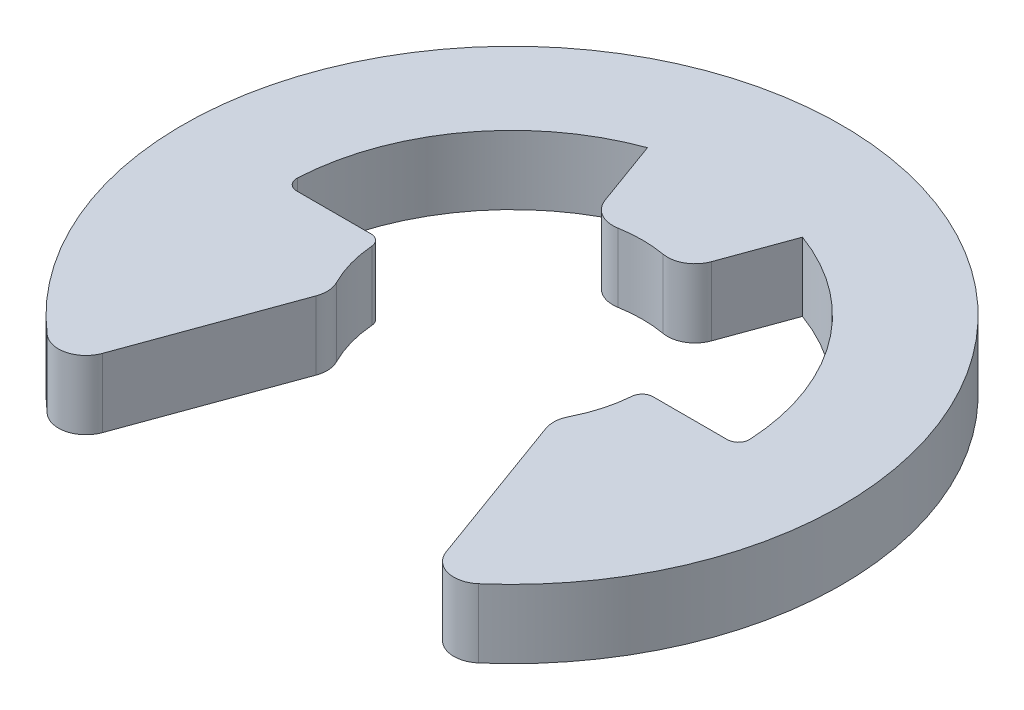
ISO-10303-21;
HEADER;
FILE_DESCRIPTION(('STEP AP214'),'2;1');
FILE_NAME('part.step','',(''),(''),'','','');
FILE_SCHEMA(('AUTOMOTIVE_DESIGN { 1 0 10303 214 1 1 1 1 }'));
ENDSEC;
DATA;
#1=APPLICATION_CONTEXT('core data for automotive mechanical design processes');
#2=APPLICATION_PROTOCOL_DEFINITION('international standard','automotive_design',2000,#1);
#3=PRODUCT_CONTEXT('',#1,'mechanical');
#4=PRODUCT('Part','Part','',(#3));
#5=PRODUCT_RELATED_PRODUCT_CATEGORY('part','',(#4));
#6=PRODUCT_DEFINITION_FORMATION('','',#4);
#7=PRODUCT_DEFINITION_CONTEXT('part definition',#1,'design');
#8=PRODUCT_DEFINITION('design','',#6,#7);
#9=PRODUCT_DEFINITION_SHAPE('','',#8);
#10=(LENGTH_UNIT() NAMED_UNIT(*) SI_UNIT(.MILLI.,.METRE.));
#11=(NAMED_UNIT(*) PLANE_ANGLE_UNIT() SI_UNIT($,.RADIAN.));
#12=(NAMED_UNIT(*) SI_UNIT($,.STERADIAN.) SOLID_ANGLE_UNIT());
#13=UNCERTAINTY_MEASURE_WITH_UNIT(LENGTH_MEASURE(1.E-05),#10,'distance_accuracy_value','');
#14=(GEOMETRIC_REPRESENTATION_CONTEXT(3) GLOBAL_UNCERTAINTY_ASSIGNED_CONTEXT((#13)) GLOBAL_UNIT_ASSIGNED_CONTEXT((#10,
#11,#12)) REPRESENTATION_CONTEXT('',''));
#15=CARTESIAN_POINT('',(0.,0.,0.));
#16=DIRECTION('',(0.,0.,1.));
#17=DIRECTION('',(1.,0.,0.));
#18=AXIS2_PLACEMENT_3D('',#15,#16,#17);
#19=CARTESIAN_POINT('',(0.,0.25,0.));
#20=DIRECTION('',(0.,-1.,0.));
#21=DIRECTION('',(0.,0.,-1.));
#22=AXIS2_PLACEMENT_3D('',#19,#20,#21);
#23=CYLINDRICAL_SURFACE('',#22,1.65);
#24=CARTESIAN_POINT('',(0.,0.25,0.));
#25=DIRECTION('',(0.,-1.,0.));
#26=DIRECTION('',(0.,0.,1.));
#27=AXIS2_PLACEMENT_3D('',#24,#25,#26);
#28=CIRCLE('',#27,1.65);
#29=CARTESIAN_POINT('',(-1.64785653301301,0.25,-0.0840764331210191));
#30=VERTEX_POINT('',#29);
#31=CARTESIAN_POINT('',(-0.564333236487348,0.25,-1.55049282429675));
#32=VERTEX_POINT('',#31);
#33=EDGE_CURVE('E187',#30,#32,#28,.T.);
#34=ORIENTED_EDGE('',*,*,#33,.F.);
#35=DIRECTION('',(0.,-1.,0.));
#36=VECTOR('',#35,1.);
#37=CARTESIAN_POINT('',(-1.64785653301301,0.25,-0.0840764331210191));
#38=LINE('',#37,#36);
#39=CARTESIAN_POINT('',(-1.64785653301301,-0.25,-0.0840764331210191));
#40=VERTEX_POINT('',#39);
#41=EDGE_CURVE('E327',#30,#40,#38,.T.);
#42=ORIENTED_EDGE('',*,*,#41,.T.);
#43=CARTESIAN_POINT('',(0.,-0.25,0.));
#44=DIRECTION('',(0.,-1.,0.));
#45=DIRECTION('',(0.,0.,1.));
#46=AXIS2_PLACEMENT_3D('',#43,#44,#45);
#47=CIRCLE('',#46,1.65);
#48=CARTESIAN_POINT('',(-0.564333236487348,-0.25,-1.55049282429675));
#49=VERTEX_POINT('',#48);
#50=EDGE_CURVE('E211',#40,#49,#47,.T.);
#51=ORIENTED_EDGE('',*,*,#50,.T.);
#52=DIRECTION('',(0.,-1.,0.));
#53=VECTOR('',#52,1.);
#54=CARTESIAN_POINT('',(-0.564333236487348,0.25,-1.55049282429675));
#55=LINE('',#54,#53);
#56=EDGE_CURVE('E204',#32,#49,#55,.T.);
#57=ORIENTED_EDGE('',*,*,#56,.F.);
#58=EDGE_LOOP('',(#34,#42,#51,#57));
#59=FACE_BOUND('',#58,.T.);
#60=ADVANCED_FACE('F39',(#59),#23,.F.);
#61=CARTESIAN_POINT('',(-0.564333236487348,0.25,-1.55049282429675));
#62=DIRECTION('',(0.939692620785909,0.,-0.342020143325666));
#63=DIRECTION('',(-0.342020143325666,0.,-0.939692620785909));
#64=AXIS2_PLACEMENT_3D('',#61,#62,#63);
#65=PLANE('',#64);
#66=DIRECTION('',(0.342020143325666,0.,0.939692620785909));
#67=VECTOR('',#66,1.);
#68=CARTESIAN_POINT('',(-0.564333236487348,-0.25,-1.55049282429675));
#69=LINE('',#68,#67);
#70=CARTESIAN_POINT('',(-0.387329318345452,-0.25,-1.06417855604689));
#71=VERTEX_POINT('',#70);
#72=EDGE_CURVE('E447',#49,#71,#69,.T.);
#73=ORIENTED_EDGE('',*,*,#72,.T.);
#74=DIRECTION('',(0.,-1.,0.));
#75=VECTOR('',#74,1.);
#76=CARTESIAN_POINT('',(-0.387329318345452,0.25,-1.06417855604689));
#77=LINE('',#76,#75);
#78=CARTESIAN_POINT('',(-0.387329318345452,0.25,-1.06417855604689));
#79=VERTEX_POINT('',#78);
#80=EDGE_CURVE('E206',#71,#79,#77,.F.);
#81=ORIENTED_EDGE('',*,*,#80,.T.);
#82=DIRECTION('',(0.342020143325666,0.,0.939692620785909));
#83=VECTOR('',#82,1.);
#84=CARTESIAN_POINT('',(-0.564333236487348,0.25,-1.55049282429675));
#85=LINE('',#84,#83);
#86=EDGE_CURVE('E191',#32,#79,#85,.T.);
#87=ORIENTED_EDGE('',*,*,#86,.F.);
#88=ORIENTED_EDGE('',*,*,#56,.T.);
#89=EDGE_LOOP('',(#73,#81,#87,#88));
#90=FACE_BOUND('',#89,.T.);
#91=ADVANCED_FACE('F203',(#90),#65,.F.);
#92=CARTESIAN_POINT('',(0.,0.25,0.));
#93=DIRECTION('',(0.,-1.,0.));
#94=DIRECTION('',(0.,0.,-1.));
#95=AXIS2_PLACEMENT_3D('',#92,#93,#94);
#96=CYLINDRICAL_SURFACE('',#95,0.95);
#97=CARTESIAN_POINT('',(0.,-0.25,0.));
#98=DIRECTION('',(0.,-1.,0.));
#99=DIRECTION('',(0.,0.,1.));
#100=AXIS2_PLACEMENT_3D('',#97,#98,#99);
#101=CIRCLE('',#100,0.95);
#102=CARTESIAN_POINT('',(-0.164714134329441,-0.25,-0.935611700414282));
#103=VERTEX_POINT('',#102);
#104=CARTESIAN_POINT('',(0.164714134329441,-0.25,-0.935611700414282));
#105=VERTEX_POINT('',#104);
#106=EDGE_CURVE('E450',#103,#105,#101,.T.);
#107=ORIENTED_EDGE('',*,*,#106,.T.);
#108=DIRECTION('',(0.,-1.,0.));
#109=VECTOR('',#108,1.);
#110=CARTESIAN_POINT('',(0.164714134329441,0.25,-0.935611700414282));
#111=LINE('',#110,#109);
#112=CARTESIAN_POINT('',(0.164714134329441,0.25,-0.935611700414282));
#113=VERTEX_POINT('',#112);
#114=EDGE_CURVE('E290',#105,#113,#111,.F.);
#115=ORIENTED_EDGE('',*,*,#114,.T.);
#116=CARTESIAN_POINT('',(0.,0.25,0.));
#117=DIRECTION('',(0.,-1.,0.));
#118=DIRECTION('',(0.,0.,1.));
#119=AXIS2_PLACEMENT_3D('',#116,#117,#118);
#120=CIRCLE('',#119,0.95);
#121=CARTESIAN_POINT('',(-0.164714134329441,0.25,-0.935611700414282));
#122=VERTEX_POINT('',#121);
#123=EDGE_CURVE('E208',#122,#113,#120,.T.);
#124=ORIENTED_EDGE('',*,*,#123,.F.);
#125=DIRECTION('',(0.,-1.,0.));
#126=VECTOR('',#125,1.);
#127=CARTESIAN_POINT('',(-0.164714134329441,0.25,-0.935611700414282));
#128=LINE('',#127,#126);
#129=EDGE_CURVE('E286',#122,#103,#128,.T.);
#130=ORIENTED_EDGE('',*,*,#129,.T.);
#131=EDGE_LOOP('',(#107,#115,#124,#130));
#132=FACE_BOUND('',#131,.T.);
#133=ADVANCED_FACE('F371',(#132),#96,.F.);
#134=CARTESIAN_POINT('',(0.324919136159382,0.25,-0.892707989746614));
#135=DIRECTION('',(-0.939692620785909,0.,-0.342020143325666));
#136=DIRECTION('',(-0.342020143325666,0.,0.93969262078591));
#137=AXIS2_PLACEMENT_3D('',#134,#135,#136);
#138=PLANE('',#137);
#139=DIRECTION('',(0.342020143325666,0.,-0.93969262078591));
#140=VECTOR('',#139,1.);
#141=CARTESIAN_POINT('',(0.324919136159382,0.25,-0.892707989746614));
#142=LINE('',#141,#140);
#143=CARTESIAN_POINT('',(0.387329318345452,0.25,-1.06417855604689));
#144=VERTEX_POINT('',#143);
#145=CARTESIAN_POINT('',(0.564333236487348,0.25,-1.55049282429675));
#146=VERTEX_POINT('',#145);
#147=EDGE_CURVE('E424',#144,#146,#142,.T.);
#148=ORIENTED_EDGE('',*,*,#147,.F.);
#149=DIRECTION('',(0.,-1.,0.));
#150=VECTOR('',#149,1.);
#151=CARTESIAN_POINT('',(0.387329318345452,0.25,-1.06417855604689));
#152=LINE('',#151,#150);
#153=CARTESIAN_POINT('',(0.387329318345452,-0.25,-1.06417855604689));
#154=VERTEX_POINT('',#153);
#155=EDGE_CURVE('E282',#144,#154,#152,.T.);
#156=ORIENTED_EDGE('',*,*,#155,.T.);
#157=DIRECTION('',(0.342020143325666,0.,-0.93969262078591));
#158=VECTOR('',#157,1.);
#159=CARTESIAN_POINT('',(0.324919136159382,-0.25,-0.892707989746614));
#160=LINE('',#159,#158);
#161=CARTESIAN_POINT('',(0.564333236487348,-0.25,-1.55049282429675));
#162=VERTEX_POINT('',#161);
#163=EDGE_CURVE('E454',#154,#162,#160,.T.);
#164=ORIENTED_EDGE('',*,*,#163,.T.);
#165=DIRECTION('',(0.,-1.,0.));
#166=VECTOR('',#165,1.);
#167=CARTESIAN_POINT('',(0.564333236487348,0.25,-1.55049282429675));
#168=LINE('',#167,#166);
#169=EDGE_CURVE('E215',#146,#162,#168,.T.);
#170=ORIENTED_EDGE('',*,*,#169,.F.);
#171=EDGE_LOOP('',(#148,#156,#164,#170));
#172=FACE_BOUND('',#171,.T.);
#173=ADVANCED_FACE('F528',(#172),#138,.F.);
#174=CARTESIAN_POINT('',(0.,0.25,0.));
#175=DIRECTION('',(0.,-1.,0.));
#176=DIRECTION('',(0.,0.,-1.));
#177=AXIS2_PLACEMENT_3D('',#174,#175,#176);
#178=CYLINDRICAL_SURFACE('',#177,1.65);
#179=CARTESIAN_POINT('',(0.,-0.25,0.));
#180=DIRECTION('',(0.,-1.,0.));
#181=DIRECTION('',(0.,0.,1.));
#182=AXIS2_PLACEMENT_3D('',#179,#180,#181);
#183=CIRCLE('',#182,1.65);
#184=CARTESIAN_POINT('',(1.64785653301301,-0.25,-0.0840764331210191));
#185=VERTEX_POINT('',#184);
#186=EDGE_CURVE('E457',#162,#185,#183,.T.);
#187=ORIENTED_EDGE('',*,*,#186,.T.);
#188=DIRECTION('',(0.,-1.,0.));
#189=VECTOR('',#188,1.);
#190=CARTESIAN_POINT('',(1.64785653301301,0.25,-0.0840764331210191));
#191=LINE('',#190,#189);
#192=CARTESIAN_POINT('',(1.64785653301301,0.25,-0.0840764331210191));
#193=VERTEX_POINT('',#192);
#194=EDGE_CURVE('E308',#185,#193,#191,.F.);
#195=ORIENTED_EDGE('',*,*,#194,.T.);
#196=CARTESIAN_POINT('',(0.,0.25,0.));
#197=DIRECTION('',(0.,-1.,0.));
#198=DIRECTION('',(0.,0.,1.));
#199=AXIS2_PLACEMENT_3D('',#196,#197,#198);
#200=CIRCLE('',#199,1.65);
#201=EDGE_CURVE('E411',#146,#193,#200,.T.);
#202=ORIENTED_EDGE('',*,*,#201,.F.);
#203=ORIENTED_EDGE('',*,*,#169,.T.);
#204=EDGE_LOOP('',(#187,#195,#202,#203));
#205=FACE_BOUND('',#204,.T.);
#206=ADVANCED_FACE('F522',(#205),#178,.F.);
#207=CARTESIAN_POINT('',(0.95,0.25,0.));
#208=DIRECTION('',(0.,0.,1.));
#209=DIRECTION('',(1.,0.,0.));
#210=AXIS2_PLACEMENT_3D('',#207,#208,#209);
#211=PLANE('',#210);
#212=DIRECTION('',(-1.,0.,0.));
#213=VECTOR('',#212,1.);
#214=CARTESIAN_POINT('',(0.95,0.25,0.));
#215=LINE('',#214,#213);
#216=CARTESIAN_POINT('',(1.5679604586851,0.25,0.));
#217=VERTEX_POINT('',#216);
#218=CARTESIAN_POINT('',(1.0268885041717,0.25,0.));
#219=VERTEX_POINT('',#218);
#220=EDGE_CURVE('E408',#217,#219,#215,.T.);
#221=ORIENTED_EDGE('',*,*,#220,.F.);
#222=DIRECTION('',(0.,1.,0.));
#223=VECTOR('',#222,1.);
#224=CARTESIAN_POINT('',(1.5679604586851,-0.25,0.));
#225=LINE('',#224,#223);
#226=CARTESIAN_POINT('',(1.5679604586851,-0.25,0.));
#227=VERTEX_POINT('',#226);
#228=EDGE_CURVE('E304',#217,#227,#225,.F.);
#229=ORIENTED_EDGE('',*,*,#228,.T.);
#230=DIRECTION('',(-1.,0.,0.));
#231=VECTOR('',#230,1.);
#232=CARTESIAN_POINT('',(0.95,-0.25,0.));
#233=LINE('',#232,#231);
#234=CARTESIAN_POINT('',(1.0268885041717,-0.25,0.));
#235=VERTEX_POINT('',#234);
#236=EDGE_CURVE('E461',#227,#235,#233,.T.);
#237=ORIENTED_EDGE('',*,*,#236,.T.);
#238=DIRECTION('',(0.,-1.,0.));
#239=VECTOR('',#238,1.);
#240=CARTESIAN_POINT('',(1.0268885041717,0.25,0.));
#241=LINE('',#240,#239);
#242=EDGE_CURVE('E301',#235,#219,#241,.F.);
#243=ORIENTED_EDGE('',*,*,#242,.T.);
#244=EDGE_LOOP('',(#221,#229,#237,#243));
#245=FACE_BOUND('',#244,.T.);
#246=ADVANCED_FACE('F413',(#245),#211,.F.);
#247=CARTESIAN_POINT('',(0.,0.25,0.));
#248=DIRECTION('',(0.,-1.,0.));
#249=DIRECTION('',(0.,0.,-1.));
#250=AXIS2_PLACEMENT_3D('',#247,#248,#249);
#251=CYLINDRICAL_SURFACE('',#250,0.95);
#252=CARTESIAN_POINT('',(0.,0.25,0.));
#253=DIRECTION('',(0.,-1.,0.));
#254=DIRECTION('',(0.,0.,1.));
#255=AXIS2_PLACEMENT_3D('',#252,#253,#254);
#256=CIRCLE('',#255,0.95);
#257=CARTESIAN_POINT('',(0.947130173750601,0.25,0.0737864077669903));
#258=VERTEX_POINT('',#257);
#259=CARTESIAN_POINT('',(0.846261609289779,0.25,0.43167266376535));
#260=VERTEX_POINT('',#259);
#261=EDGE_CURVE('E418',#258,#260,#256,.T.);
#262=ORIENTED_EDGE('',*,*,#261,.F.);
#263=DIRECTION('',(0.,-1.,0.));
#264=VECTOR('',#263,1.);
#265=CARTESIAN_POINT('',(0.947130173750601,0.25,0.0737864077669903));
#266=LINE('',#265,#264);
#267=CARTESIAN_POINT('',(0.947130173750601,-0.25,0.0737864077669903));
#268=VERTEX_POINT('',#267);
#269=EDGE_CURVE('E311',#258,#268,#266,.T.);
#270=ORIENTED_EDGE('',*,*,#269,.T.);
#271=CARTESIAN_POINT('',(0.,-0.25,0.));
#272=DIRECTION('',(0.,-1.,0.));
#273=DIRECTION('',(0.,0.,1.));
#274=AXIS2_PLACEMENT_3D('',#271,#272,#273);
#275=CIRCLE('',#274,0.95);
#276=CARTESIAN_POINT('',(0.846261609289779,-0.25,0.43167266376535));
#277=VERTEX_POINT('',#276);
#278=EDGE_CURVE('E464',#268,#277,#275,.T.);
#279=ORIENTED_EDGE('',*,*,#278,.T.);
#280=DIRECTION('',(0.,-1.,0.));
#281=VECTOR('',#280,1.);
#282=CARTESIAN_POINT('',(0.846261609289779,0.25,0.43167266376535));
#283=LINE('',#282,#281);
#284=EDGE_CURVE('E249',#277,#260,#283,.F.);
#285=ORIENTED_EDGE('',*,*,#284,.T.);
#286=EDGE_LOOP('',(#262,#270,#279,#285));
#287=FACE_BOUND('',#286,.T.);
#288=ADVANCED_FACE('F513',(#287),#251,.F.);
#289=CARTESIAN_POINT('',(0.804999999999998,0.25,0.50445515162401));
#290=DIRECTION('',(0.939692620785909,0.,-0.342020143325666));
#291=DIRECTION('',(-0.342020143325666,0.,-0.939692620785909));
#292=AXIS2_PLACEMENT_3D('',#289,#290,#291);
#293=PLANE('',#292);
#294=DIRECTION('',(0.342020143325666,0.,0.939692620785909));
#295=VECTOR('',#294,1.);
#296=CARTESIAN_POINT('',(0.804999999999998,0.25,0.50445515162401));
#297=LINE('',#296,#295);
#298=CARTESIAN_POINT('',(0.836483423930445,0.25,0.590955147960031));
#299=VERTEX_POINT('',#298);
#300=CARTESIAN_POINT('',(1.2517590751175,0.25,1.7319156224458));
#301=VERTEX_POINT('',#300);
#302=EDGE_CURVE('E421',#299,#301,#297,.T.);
#303=ORIENTED_EDGE('',*,*,#302,.F.);
#304=DIRECTION('',(0.,-1.,0.));
#305=VECTOR('',#304,1.);
#306=CARTESIAN_POINT('',(0.836483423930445,0.25,0.590955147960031));
#307=LINE('',#306,#305);
#308=CARTESIAN_POINT('',(0.836483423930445,-0.25,0.590955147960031));
#309=VERTEX_POINT('',#308);
#310=EDGE_CURVE('E220',#299,#309,#307,.T.);
#311=ORIENTED_EDGE('',*,*,#310,.T.);
#312=DIRECTION('',(0.342020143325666,0.,0.939692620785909));
#313=VECTOR('',#312,1.);
#314=CARTESIAN_POINT('',(0.804999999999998,-0.25,0.50445515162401));
#315=LINE('',#314,#313);
#316=CARTESIAN_POINT('',(1.2517590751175,-0.25,1.7319156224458));
#317=VERTEX_POINT('',#316);
#318=EDGE_CURVE('E467',#309,#317,#315,.T.);
#319=ORIENTED_EDGE('',*,*,#318,.T.);
#320=DIRECTION('',(0.,-1.,0.));
#321=VECTOR('',#320,1.);
#322=CARTESIAN_POINT('',(1.25175907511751,0.25,1.7319156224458));
#323=LINE('',#322,#321);
#324=EDGE_CURVE('E214',#317,#301,#323,.F.);
#325=ORIENTED_EDGE('',*,*,#324,.T.);
#326=EDGE_LOOP('',(#303,#311,#319,#325));
#327=FACE_BOUND('',#326,.T.);
#328=ADVANCED_FACE('F507',(#327),#293,.F.);
#329=CARTESIAN_POINT('',(0.,0.25,0.));
#330=DIRECTION('',(0.,-1.,0.));
#331=DIRECTION('',(0.,0.,-1.));
#332=AXIS2_PLACEMENT_3D('',#329,#330,#331);
#333=CYLINDRICAL_SURFACE('',#332,2.4);
#334=CARTESIAN_POINT('',(0.,0.25,0.));
#335=DIRECTION('',(0.,1.,0.));
#336=DIRECTION('',(0.,0.,1.));
#337=AXIS2_PLACEMENT_3D('',#334,#335,#336);
#338=CIRCLE('',#337,2.4);
#339=CARTESIAN_POINT('',(1.57057919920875,0.25,1.814739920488));
#340=VERTEX_POINT('',#339);
#341=CARTESIAN_POINT('',(-1.57057919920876,0.25,1.81473992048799));
#342=VERTEX_POINT('',#341);
#343=EDGE_CURVE('E431',#340,#342,#338,.T.);
#344=ORIENTED_EDGE('',*,*,#343,.F.);
#345=DIRECTION('',(0.,-1.,0.));
#346=VECTOR('',#345,1.);
#347=CARTESIAN_POINT('',(1.57057919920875,0.25,1.814739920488));
#348=LINE('',#347,#346);
#349=CARTESIAN_POINT('',(1.57057919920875,-0.25,1.814739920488));
#350=VERTEX_POINT('',#349);
#351=EDGE_CURVE('E297',#340,#350,#348,.T.);
#352=ORIENTED_EDGE('',*,*,#351,.T.);
#353=CARTESIAN_POINT('',(0.,-0.25,0.));
#354=DIRECTION('',(0.,1.,0.));
#355=DIRECTION('',(0.,0.,1.));
#356=AXIS2_PLACEMENT_3D('',#353,#354,#355);
#357=CIRCLE('',#356,2.4);
#358=CARTESIAN_POINT('',(-1.57057919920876,-0.25,1.81473992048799));
#359=VERTEX_POINT('',#358);
#360=EDGE_CURVE('E471',#350,#359,#357,.T.);
#361=ORIENTED_EDGE('',*,*,#360,.T.);
#362=DIRECTION('',(0.,-1.,0.));
#363=VECTOR('',#362,1.);
#364=CARTESIAN_POINT('',(-1.57057919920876,0.25,1.81473992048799));
#365=LINE('',#364,#363);
#366=EDGE_CURVE('E294',#359,#342,#365,.F.);
#367=ORIENTED_EDGE('',*,*,#366,.T.);
#368=EDGE_LOOP('',(#344,#352,#361,#367));
#369=FACE_BOUND('',#368,.T.);
#370=ADVANCED_FACE('F500',(#369),#333,.T.);
#371=CARTESIAN_POINT('',(-1.34488697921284,0.25,1.98778243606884));
#372=DIRECTION('',(-0.939692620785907,0.,-0.342020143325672));
#373=DIRECTION('',(-0.342020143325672,0.,0.939692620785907));
#374=AXIS2_PLACEMENT_3D('',#371,#372,#373);
#375=PLANE('',#374);
#376=DIRECTION('',(0.342020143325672,0.,-0.939692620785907));
#377=VECTOR('',#376,1.);
#378=CARTESIAN_POINT('',(-1.34488697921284,-0.25,1.98778243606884));
#379=LINE('',#378,#377);
#380=CARTESIAN_POINT('',(-1.25175907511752,-0.25,1.73191562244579));
#381=VERTEX_POINT('',#380);
#382=CARTESIAN_POINT('',(-0.83648342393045,-0.25,0.590955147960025));
#383=VERTEX_POINT('',#382);
#384=EDGE_CURVE('E475',#381,#383,#379,.T.);
#385=ORIENTED_EDGE('',*,*,#384,.T.);
#386=DIRECTION('',(0.,-1.,0.));
#387=VECTOR('',#386,1.);
#388=CARTESIAN_POINT('',(-0.83648342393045,0.25,0.590955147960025));
#389=LINE('',#388,#387);
#390=CARTESIAN_POINT('',(-0.83648342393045,0.25,0.590955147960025));
#391=VERTEX_POINT('',#390);
#392=EDGE_CURVE('E279',#383,#391,#389,.F.);
#393=ORIENTED_EDGE('',*,*,#392,.T.);
#394=DIRECTION('',(0.342020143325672,0.,-0.939692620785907));
#395=VECTOR('',#394,1.);
#396=CARTESIAN_POINT('',(-1.34488697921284,0.25,1.98778243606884));
#397=LINE('',#396,#395);
#398=CARTESIAN_POINT('',(-1.25175907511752,0.25,1.73191562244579));
#399=VERTEX_POINT('',#398);
#400=EDGE_CURVE('E435',#399,#391,#397,.T.);
#401=ORIENTED_EDGE('',*,*,#400,.F.);
#402=DIRECTION('',(0.,-1.,0.));
#403=VECTOR('',#402,1.);
#404=CARTESIAN_POINT('',(-1.25175907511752,0.25,1.73191562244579));
#405=LINE('',#404,#403);
#406=EDGE_CURVE('E275',#399,#381,#405,.T.);
#407=ORIENTED_EDGE('',*,*,#406,.T.);
#408=EDGE_LOOP('',(#385,#393,#401,#407));
#409=FACE_BOUND('',#408,.T.);
#410=ADVANCED_FACE('F492',(#409),#375,.F.);
#411=CARTESIAN_POINT('',(0.,0.25,0.));
#412=DIRECTION('',(0.,-1.,0.));
#413=DIRECTION('',(0.,0.,-1.));
#414=AXIS2_PLACEMENT_3D('',#411,#412,#413);
#415=CYLINDRICAL_SURFACE('',#414,0.95);
#416=CARTESIAN_POINT('',(0.,-0.25,0.));
#417=DIRECTION('',(0.,-1.,0.));
#418=DIRECTION('',(0.,0.,1.));
#419=AXIS2_PLACEMENT_3D('',#416,#417,#418);
#420=CIRCLE('',#419,0.95);
#421=CARTESIAN_POINT('',(-0.846261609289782,-0.25,0.431672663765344));
#422=VERTEX_POINT('',#421);
#423=CARTESIAN_POINT('',(-0.947130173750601,-0.25,0.0737864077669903));
#424=VERTEX_POINT('',#423);
#425=EDGE_CURVE('E354',#422,#424,#420,.T.);
#426=ORIENTED_EDGE('',*,*,#425,.T.);
#427=DIRECTION('',(0.,-1.,0.));
#428=VECTOR('',#427,1.);
#429=CARTESIAN_POINT('',(-0.947130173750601,0.25,0.0737864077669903));
#430=LINE('',#429,#428);
#431=CARTESIAN_POINT('',(-0.947130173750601,0.25,0.0737864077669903));
#432=VERTEX_POINT('',#431);
#433=EDGE_CURVE('E336',#424,#432,#430,.F.);
#434=ORIENTED_EDGE('',*,*,#433,.T.);
#435=CARTESIAN_POINT('',(0.,0.25,0.));
#436=DIRECTION('',(0.,-1.,0.));
#437=DIRECTION('',(0.,0.,1.));
#438=AXIS2_PLACEMENT_3D('',#435,#436,#437);
#439=CIRCLE('',#438,0.95);
#440=CARTESIAN_POINT('',(-0.846261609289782,0.25,0.431672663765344));
#441=VERTEX_POINT('',#440);
#442=EDGE_CURVE('E439',#441,#432,#439,.T.);
#443=ORIENTED_EDGE('',*,*,#442,.F.);
#444=DIRECTION('',(0.,-1.,0.));
#445=VECTOR('',#444,1.);
#446=CARTESIAN_POINT('',(-0.846261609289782,0.25,0.431672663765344));
#447=LINE('',#446,#445);
#448=EDGE_CURVE('E271',#441,#422,#447,.T.);
#449=ORIENTED_EDGE('',*,*,#448,.T.);
#450=EDGE_LOOP('',(#426,#434,#443,#449));
#451=FACE_BOUND('',#450,.T.);
#452=ADVANCED_FACE('F484',(#451),#415,.F.);
#453=CARTESIAN_POINT('',(-0.95,0.25,0.));
#454=DIRECTION('',(0.,0.,1.));
#455=DIRECTION('',(1.,0.,0.));
#456=AXIS2_PLACEMENT_3D('',#453,#454,#455);
#457=PLANE('',#456);
#458=DIRECTION('',(-1.,0.,0.));
#459=VECTOR('',#458,1.);
#460=CARTESIAN_POINT('',(-0.95,-0.25,0.));
#461=LINE('',#460,#459);
#462=CARTESIAN_POINT('',(-1.0268885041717,-0.25,0.));
#463=VERTEX_POINT('',#462);
#464=CARTESIAN_POINT('',(-1.5679604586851,-0.25,0.));
#465=VERTEX_POINT('',#464);
#466=EDGE_CURVE('E198',#463,#465,#461,.T.);
#467=ORIENTED_EDGE('',*,*,#466,.T.);
#468=DIRECTION('',(0.,1.,0.));
#469=VECTOR('',#468,1.);
#470=CARTESIAN_POINT('',(-1.5679604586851,0.25,0.));
#471=LINE('',#470,#469);
#472=CARTESIAN_POINT('',(-1.5679604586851,0.25,0.));
#473=VERTEX_POINT('',#472);
#474=EDGE_CURVE('E61',#465,#473,#471,.T.);
#475=ORIENTED_EDGE('',*,*,#474,.T.);
#476=DIRECTION('',(-1.,0.,0.));
#477=VECTOR('',#476,1.);
#478=CARTESIAN_POINT('',(-0.95,0.25,0.));
#479=LINE('',#478,#477);
#480=CARTESIAN_POINT('',(-1.0268885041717,0.25,0.));
#481=VERTEX_POINT('',#480);
#482=EDGE_CURVE('E224',#481,#473,#479,.T.);
#483=ORIENTED_EDGE('',*,*,#482,.F.);
#484=DIRECTION('',(0.,-1.,0.));
#485=VECTOR('',#484,1.);
#486=CARTESIAN_POINT('',(-1.0268885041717,0.25,0.));
#487=LINE('',#486,#485);
#488=EDGE_CURVE('E330',#481,#463,#487,.T.);
#489=ORIENTED_EDGE('',*,*,#488,.T.);
#490=EDGE_LOOP('',(#467,#475,#483,#489));
#491=FACE_BOUND('',#490,.T.);
#492=ADVANCED_FACE('F351',(#491),#457,.F.);
#493=CARTESIAN_POINT('',(0.,0.25,0.));
#494=DIRECTION('',(0.,1.,0.));
#495=DIRECTION('',(0.,0.,1.));
#496=AXIS2_PLACEMENT_3D('',#493,#494,#495);
#497=PLANE('',#496);
#498=ORIENTED_EDGE('',*,*,#220,.T.);
#499=CARTESIAN_POINT('',(1.0268885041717,0.25,0.08));
#500=DIRECTION('',(0.,1.,0.));
#501=DIRECTION('',(0.,0.,1.));
#502=AXIS2_PLACEMENT_3D('',#499,#500,#501);
#503=CIRCLE('',#502,0.08);
#504=EDGE_CURVE('E324',#219,#258,#503,.T.);
#505=ORIENTED_EDGE('',*,*,#504,.T.);
#506=ORIENTED_EDGE('',*,*,#261,.T.);
#507=CARTESIAN_POINT('',(1.02442194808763,0.25,0.522551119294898));
#508=DIRECTION('',(0.,1.,0.));
#509=DIRECTION('',(0.,0.,1.));
#510=AXIS2_PLACEMENT_3D('',#507,#508,#509);
#511=CIRCLE('',#510,0.2);
#512=EDGE_CURVE('E268',#260,#299,#511,.T.);
#513=ORIENTED_EDGE('',*,*,#512,.T.);
#514=ORIENTED_EDGE('',*,*,#302,.T.);
#515=CARTESIAN_POINT('',(1.43969759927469,0.25,1.66351159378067));
#516=DIRECTION('',(0.,1.,0.));
#517=DIRECTION('',(0.,0.,1.));
#518=AXIS2_PLACEMENT_3D('',#515,#516,#517);
#519=CIRCLE('',#518,0.2);
#520=EDGE_CURVE('E256',#301,#340,#519,.T.);
#521=ORIENTED_EDGE('',*,*,#520,.T.);
#522=ORIENTED_EDGE('',*,*,#343,.T.);
#523=CARTESIAN_POINT('',(-1.4396975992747,0.25,1.66351159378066));
#524=DIRECTION('',(0.,1.,0.));
#525=DIRECTION('',(0.,0.,1.));
#526=AXIS2_PLACEMENT_3D('',#523,#524,#525);
#527=CIRCLE('',#526,0.2);
#528=EDGE_CURVE('E253',#342,#399,#527,.T.);
#529=ORIENTED_EDGE('',*,*,#528,.T.);
#530=ORIENTED_EDGE('',*,*,#400,.T.);
#531=CARTESIAN_POINT('',(-1.02442194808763,0.25,0.52255111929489));
#532=DIRECTION('',(0.,1.,0.));
#533=DIRECTION('',(0.,0.,1.));
#534=AXIS2_PLACEMENT_3D('',#531,#532,#533);
#535=CIRCLE('',#534,0.2);
#536=EDGE_CURVE('E265',#391,#441,#535,.T.);
#537=ORIENTED_EDGE('',*,*,#536,.T.);
#538=ORIENTED_EDGE('',*,*,#442,.T.);
#539=CARTESIAN_POINT('',(-1.0268885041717,0.25,0.08));
#540=DIRECTION('',(0.,1.,0.));
#541=DIRECTION('',(0.,0.,1.));
#542=AXIS2_PLACEMENT_3D('',#539,#540,#541);
#543=CIRCLE('',#542,0.08);
#544=EDGE_CURVE('E321',#432,#481,#543,.T.);
#545=ORIENTED_EDGE('',*,*,#544,.T.);
#546=ORIENTED_EDGE('',*,*,#482,.T.);
#547=CARTESIAN_POINT('',(-1.5679604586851,0.25,-0.08));
#548=DIRECTION('',(0.,1.,0.));
#549=DIRECTION('',(0.,0.,1.));
#550=AXIS2_PLACEMENT_3D('',#547,#548,#549);
#551=CIRCLE('',#550,0.08);
#552=EDGE_CURVE('E11',#473,#30,#551,.F.);
#553=ORIENTED_EDGE('',*,*,#552,.T.);
#554=ORIENTED_EDGE('',*,*,#33,.T.);
#555=ORIENTED_EDGE('',*,*,#86,.T.);
#556=CARTESIAN_POINT('',(-0.19939079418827,0.25,-1.13258258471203));
#557=DIRECTION('',(0.,1.,0.));
#558=DIRECTION('',(0.,0.,1.));
#559=AXIS2_PLACEMENT_3D('',#556,#557,#558);
#560=CIRCLE('',#559,0.2);
#561=EDGE_CURVE('E259',#79,#122,#560,.T.);
#562=ORIENTED_EDGE('',*,*,#561,.T.);
#563=ORIENTED_EDGE('',*,*,#123,.T.);
#564=CARTESIAN_POINT('',(0.19939079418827,0.25,-1.13258258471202));
#565=DIRECTION('',(0.,1.,0.));
#566=DIRECTION('',(0.,0.,1.));
#567=AXIS2_PLACEMENT_3D('',#564,#565,#566);
#568=CIRCLE('',#567,0.2);
#569=EDGE_CURVE('E262',#113,#144,#568,.T.);
#570=ORIENTED_EDGE('',*,*,#569,.T.);
#571=ORIENTED_EDGE('',*,*,#147,.T.);
#572=ORIENTED_EDGE('',*,*,#201,.T.);
#573=CARTESIAN_POINT('',(1.5679604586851,0.25,-0.08));
#574=DIRECTION('',(0.,1.,0.));
#575=DIRECTION('',(0.,0.,1.));
#576=AXIS2_PLACEMENT_3D('',#573,#574,#575);
#577=CIRCLE('',#576,0.08);
#578=EDGE_CURVE('E342',#193,#217,#577,.F.);
#579=ORIENTED_EDGE('',*,*,#578,.T.);
#580=EDGE_LOOP('',(#498,#505,#506,#513,#514,#521,#522,#529,#530,#537,#538,#545,#546,#553,#554,
#555,#562,#563,#570,#571,#572,#579));
#581=FACE_BOUND('',#580,.T.);
#582=ADVANCED_FACE('F190',(#581),#497,.T.);
#583=CARTESIAN_POINT('',(0.,-0.25,0.));
#584=DIRECTION('',(0.,1.,0.));
#585=DIRECTION('',(0.,0.,1.));
#586=AXIS2_PLACEMENT_3D('',#583,#584,#585);
#587=PLANE('',#586);
#588=ORIENTED_EDGE('',*,*,#278,.F.);
#589=CARTESIAN_POINT('',(1.0268885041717,-0.25,0.08));
#590=DIRECTION('',(0.,1.,0.));
#591=DIRECTION('',(0.,0.,1.));
#592=AXIS2_PLACEMENT_3D('',#589,#590,#591);
#593=CIRCLE('',#592,0.08);
#594=EDGE_CURVE('E318',#268,#235,#593,.F.);
#595=ORIENTED_EDGE('',*,*,#594,.T.);
#596=ORIENTED_EDGE('',*,*,#236,.F.);
#597=CARTESIAN_POINT('',(1.5679604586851,-0.25,-0.08));
#598=DIRECTION('',(0.,1.,0.));
#599=DIRECTION('',(0.,0.,1.));
#600=AXIS2_PLACEMENT_3D('',#597,#598,#599);
#601=CIRCLE('',#600,0.08);
#602=EDGE_CURVE('E339',#227,#185,#601,.T.);
#603=ORIENTED_EDGE('',*,*,#602,.T.);
#604=ORIENTED_EDGE('',*,*,#186,.F.);
#605=ORIENTED_EDGE('',*,*,#163,.F.);
#606=CARTESIAN_POINT('',(0.19939079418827,-0.25,-1.13258258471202));
#607=DIRECTION('',(0.,1.,0.));
#608=DIRECTION('',(0.,0.,1.));
#609=AXIS2_PLACEMENT_3D('',#606,#607,#608);
#610=CIRCLE('',#609,0.2);
#611=EDGE_CURVE('E240',#154,#105,#610,.F.);
#612=ORIENTED_EDGE('',*,*,#611,.T.);
#613=ORIENTED_EDGE('',*,*,#106,.F.);
#614=CARTESIAN_POINT('',(-0.19939079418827,-0.25,-1.13258258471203));
#615=DIRECTION('',(0.,1.,0.));
#616=DIRECTION('',(0.,0.,1.));
#617=AXIS2_PLACEMENT_3D('',#614,#615,#616);
#618=CIRCLE('',#617,0.2);
#619=EDGE_CURVE('E237',#103,#71,#618,.F.);
#620=ORIENTED_EDGE('',*,*,#619,.T.);
#621=ORIENTED_EDGE('',*,*,#72,.F.);
#622=ORIENTED_EDGE('',*,*,#50,.F.);
#623=CARTESIAN_POINT('',(-1.5679604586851,-0.25,-0.08));
#624=DIRECTION('',(0.,1.,0.));
#625=DIRECTION('',(0.,0.,1.));
#626=AXIS2_PLACEMENT_3D('',#623,#624,#625);
#627=CIRCLE('',#626,0.08);
#628=EDGE_CURVE('E48',#40,#465,#627,.T.);
#629=ORIENTED_EDGE('',*,*,#628,.T.);
#630=ORIENTED_EDGE('',*,*,#466,.F.);
#631=CARTESIAN_POINT('',(-1.0268885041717,-0.25,0.08));
#632=DIRECTION('',(0.,1.,0.));
#633=DIRECTION('',(0.,0.,1.));
#634=AXIS2_PLACEMENT_3D('',#631,#632,#633);
#635=CIRCLE('',#634,0.08);
#636=EDGE_CURVE('E315',#463,#424,#635,.F.);
#637=ORIENTED_EDGE('',*,*,#636,.T.);
#638=ORIENTED_EDGE('',*,*,#425,.F.);
#639=CARTESIAN_POINT('',(-1.02442194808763,-0.25,0.52255111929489));
#640=DIRECTION('',(0.,1.,0.));
#641=DIRECTION('',(0.,0.,1.));
#642=AXIS2_PLACEMENT_3D('',#639,#640,#641);
#643=CIRCLE('',#642,0.2);
#644=EDGE_CURVE('E243',#422,#383,#643,.F.);
#645=ORIENTED_EDGE('',*,*,#644,.T.);
#646=ORIENTED_EDGE('',*,*,#384,.F.);
#647=CARTESIAN_POINT('',(-1.4396975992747,-0.25,1.66351159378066));
#648=DIRECTION('',(0.,1.,0.));
#649=DIRECTION('',(0.,0.,1.));
#650=AXIS2_PLACEMENT_3D('',#647,#648,#649);
#651=CIRCLE('',#650,0.2);
#652=EDGE_CURVE('E231',#381,#359,#651,.F.);
#653=ORIENTED_EDGE('',*,*,#652,.T.);
#654=ORIENTED_EDGE('',*,*,#360,.F.);
#655=CARTESIAN_POINT('',(1.43969759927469,-0.25,1.66351159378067));
#656=DIRECTION('',(0.,1.,0.));
#657=DIRECTION('',(0.,0.,1.));
#658=AXIS2_PLACEMENT_3D('',#655,#656,#657);
#659=CIRCLE('',#658,0.2);
#660=EDGE_CURVE('E234',#350,#317,#659,.F.);
#661=ORIENTED_EDGE('',*,*,#660,.T.);
#662=ORIENTED_EDGE('',*,*,#318,.F.);
#663=CARTESIAN_POINT('',(1.02442194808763,-0.25,0.522551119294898));
#664=DIRECTION('',(0.,1.,0.));
#665=DIRECTION('',(0.,0.,1.));
#666=AXIS2_PLACEMENT_3D('',#663,#664,#665);
#667=CIRCLE('',#666,0.2);
#668=EDGE_CURVE('E245',#309,#277,#667,.F.);
#669=ORIENTED_EDGE('',*,*,#668,.T.);
#670=EDGE_LOOP('',(#588,#595,#596,#603,#604,#605,#612,#613,#620,#621,#622,#629,#630,#637,#638,
#645,#646,#653,#654,#661,#662,#669));
#671=FACE_BOUND('',#670,.T.);
#672=ADVANCED_FACE('F349',(#671),#587,.F.);
#673=CARTESIAN_POINT('',(1.02442194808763,0.25,0.522551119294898));
#674=DIRECTION('',(0.,-1.,0.));
#675=DIRECTION('',(0.,0.,-1.));
#676=AXIS2_PLACEMENT_3D('',#673,#674,#675);
#677=CYLINDRICAL_SURFACE('',#676,0.2);
#678=ORIENTED_EDGE('',*,*,#512,.F.);
#679=ORIENTED_EDGE('',*,*,#284,.F.);
#680=ORIENTED_EDGE('',*,*,#668,.F.);
#681=ORIENTED_EDGE('',*,*,#310,.F.);
#682=EDGE_LOOP('',(#678,#679,#680,#681));
#683=FACE_BOUND('',#682,.T.);
#684=ADVANCED_FACE('F375',(#683),#677,.T.);
#685=CARTESIAN_POINT('',(-1.02442194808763,0.25,0.52255111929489));
#686=DIRECTION('',(0.,-1.,0.));
#687=DIRECTION('',(0.,0.,-1.));
#688=AXIS2_PLACEMENT_3D('',#685,#686,#687);
#689=CYLINDRICAL_SURFACE('',#688,0.2);
#690=ORIENTED_EDGE('',*,*,#536,.F.);
#691=ORIENTED_EDGE('',*,*,#392,.F.);
#692=ORIENTED_EDGE('',*,*,#644,.F.);
#693=ORIENTED_EDGE('',*,*,#448,.F.);
#694=EDGE_LOOP('',(#690,#691,#692,#693));
#695=FACE_BOUND('',#694,.T.);
#696=ADVANCED_FACE('F378',(#695),#689,.T.);
#697=CARTESIAN_POINT('',(0.19939079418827,0.25,-1.13258258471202));
#698=DIRECTION('',(0.,-1.,0.));
#699=DIRECTION('',(0.,0.,-1.));
#700=AXIS2_PLACEMENT_3D('',#697,#698,#699);
#701=CYLINDRICAL_SURFACE('',#700,0.2);
#702=ORIENTED_EDGE('',*,*,#569,.F.);
#703=ORIENTED_EDGE('',*,*,#114,.F.);
#704=ORIENTED_EDGE('',*,*,#611,.F.);
#705=ORIENTED_EDGE('',*,*,#155,.F.);
#706=EDGE_LOOP('',(#702,#703,#704,#705));
#707=FACE_BOUND('',#706,.T.);
#708=ADVANCED_FACE('F382',(#707),#701,.T.);
#709=CARTESIAN_POINT('',(-0.19939079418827,0.25,-1.13258258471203));
#710=DIRECTION('',(0.,-1.,0.));
#711=DIRECTION('',(0.,0.,-1.));
#712=AXIS2_PLACEMENT_3D('',#709,#710,#711);
#713=CYLINDRICAL_SURFACE('',#712,0.2);
#714=ORIENTED_EDGE('',*,*,#561,.F.);
#715=ORIENTED_EDGE('',*,*,#80,.F.);
#716=ORIENTED_EDGE('',*,*,#619,.F.);
#717=ORIENTED_EDGE('',*,*,#129,.F.);
#718=EDGE_LOOP('',(#714,#715,#716,#717));
#719=FACE_BOUND('',#718,.T.);
#720=ADVANCED_FACE('F386',(#719),#713,.T.);
#721=CARTESIAN_POINT('',(1.43969759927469,0.25,1.66351159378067));
#722=DIRECTION('',(0.,-1.,0.));
#723=DIRECTION('',(0.,0.,-1.));
#724=AXIS2_PLACEMENT_3D('',#721,#722,#723);
#725=CYLINDRICAL_SURFACE('',#724,0.2);
#726=ORIENTED_EDGE('',*,*,#520,.F.);
#727=ORIENTED_EDGE('',*,*,#324,.F.);
#728=ORIENTED_EDGE('',*,*,#660,.F.);
#729=ORIENTED_EDGE('',*,*,#351,.F.);
#730=EDGE_LOOP('',(#726,#727,#728,#729));
#731=FACE_BOUND('',#730,.T.);
#732=ADVANCED_FACE('F390',(#731),#725,.T.);
#733=CARTESIAN_POINT('',(-1.4396975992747,0.25,1.66351159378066));
#734=DIRECTION('',(0.,-1.,0.));
#735=DIRECTION('',(0.,0.,-1.));
#736=AXIS2_PLACEMENT_3D('',#733,#734,#735);
#737=CYLINDRICAL_SURFACE('',#736,0.2);
#738=ORIENTED_EDGE('',*,*,#528,.F.);
#739=ORIENTED_EDGE('',*,*,#366,.F.);
#740=ORIENTED_EDGE('',*,*,#652,.F.);
#741=ORIENTED_EDGE('',*,*,#406,.F.);
#742=EDGE_LOOP('',(#738,#739,#740,#741));
#743=FACE_BOUND('',#742,.T.);
#744=ADVANCED_FACE('F394',(#743),#737,.T.);
#745=CARTESIAN_POINT('',(1.5679604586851,0.25,-0.08));
#746=DIRECTION('',(0.,-1.,0.));
#747=DIRECTION('',(0.,0.,-1.));
#748=AXIS2_PLACEMENT_3D('',#745,#746,#747);
#749=CYLINDRICAL_SURFACE('',#748,0.08);
#750=ORIENTED_EDGE('',*,*,#578,.F.);
#751=ORIENTED_EDGE('',*,*,#194,.F.);
#752=ORIENTED_EDGE('',*,*,#602,.F.);
#753=ORIENTED_EDGE('',*,*,#228,.F.);
#754=EDGE_LOOP('',(#750,#751,#752,#753));
#755=FACE_BOUND('',#754,.T.);
#756=ADVANCED_FACE('F363',(#755),#749,.F.);
#757=CARTESIAN_POINT('',(1.0268885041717,0.25,0.08));
#758=DIRECTION('',(0.,-1.,0.));
#759=DIRECTION('',(0.,0.,-1.));
#760=AXIS2_PLACEMENT_3D('',#757,#758,#759);
#761=CYLINDRICAL_SURFACE('',#760,0.08);
#762=ORIENTED_EDGE('',*,*,#504,.F.);
#763=ORIENTED_EDGE('',*,*,#242,.F.);
#764=ORIENTED_EDGE('',*,*,#594,.F.);
#765=ORIENTED_EDGE('',*,*,#269,.F.);
#766=EDGE_LOOP('',(#762,#763,#764,#765));
#767=FACE_BOUND('',#766,.T.);
#768=ADVANCED_FACE('F357',(#767),#761,.T.);
#769=CARTESIAN_POINT('',(-1.5679604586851,0.25,-0.08));
#770=DIRECTION('',(0.,-1.,0.));
#771=DIRECTION('',(0.,0.,-1.));
#772=AXIS2_PLACEMENT_3D('',#769,#770,#771);
#773=CYLINDRICAL_SURFACE('',#772,0.08);
#774=ORIENTED_EDGE('',*,*,#552,.F.);
#775=ORIENTED_EDGE('',*,*,#474,.F.);
#776=ORIENTED_EDGE('',*,*,#628,.F.);
#777=ORIENTED_EDGE('',*,*,#41,.F.);
#778=EDGE_LOOP('',(#774,#775,#776,#777));
#779=FACE_BOUND('',#778,.T.);
#780=ADVANCED_FACE('F355',(#779),#773,.F.);
#781=CARTESIAN_POINT('',(-1.0268885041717,0.25,0.08));
#782=DIRECTION('',(0.,-1.,0.));
#783=DIRECTION('',(0.,0.,-1.));
#784=AXIS2_PLACEMENT_3D('',#781,#782,#783);
#785=CYLINDRICAL_SURFACE('',#784,0.08);
#786=ORIENTED_EDGE('',*,*,#544,.F.);
#787=ORIENTED_EDGE('',*,*,#433,.F.);
#788=ORIENTED_EDGE('',*,*,#636,.F.);
#789=ORIENTED_EDGE('',*,*,#488,.F.);
#790=EDGE_LOOP('',(#786,#787,#788,#789));
#791=FACE_BOUND('',#790,.T.);
#792=ADVANCED_FACE('F41',(#791),#785,.T.);
#793=CLOSED_SHELL('',(#60,#91,#133,#173,#206,#246,#288,#328,#370,#410,#452,#492,#582,#672,#684,
#696,#708,#720,#732,#744,#756,#768,#780,#792));
#794=MANIFOLD_SOLID_BREP('B2',#793);
#795=ADVANCED_BREP_SHAPE_REPRESENTATION('',(#18,#794),#14);
#796=SHAPE_DEFINITION_REPRESENTATION(#9,#795);
ENDSEC;
END-ISO-10303-21;
